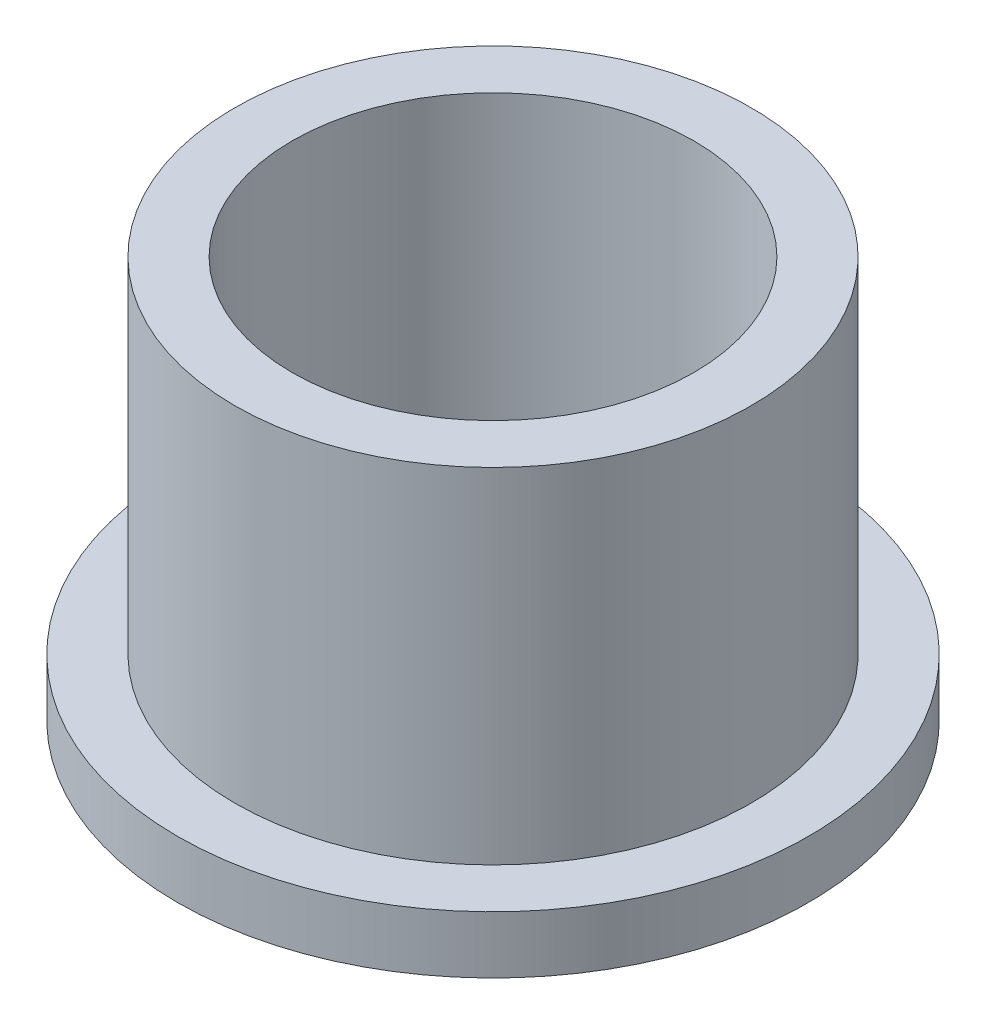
from build123d import *

# Parameters (mm, degrees)
SKETCH2_R           = 9
SKETCH2_R_2         = 7
BOSS_EXTRUDE1_DEPTH = 14
SKETCH3_R           = 11
SKETCH3_R_2         = 9
BOSS_EXTRUDE2_DEPTH = 2


with BuildPart() as part:
    # Sketch2 → Boss-Extrude1 (new body)
    with BuildSketch(Plane(origin=(0, 0, 0), x_dir=(1, 0, 0), z_dir=(0, 1, 0))):
        with Locations(Location((0, 0, 0), (0, 0, 270))):
            Circle(SKETCH2_R)
        with Locations(Location((0, 0, 0), (0, 0, 270))):
            Circle(SKETCH2_R_2, mode=Mode.SUBTRACT)
    extrude(amount=BOSS_EXTRUDE1_DEPTH)

    # Sketch3 → Boss-Extrude2 (add)
    with BuildSketch(Plane(origin=(0, 0, 0), x_dir=(1, 0, 0), z_dir=(0, 1, 0))):
        with Locations(Location((0, 0, 0), (0, 0, 270))):
            Circle(SKETCH3_R)
        with Locations(Location((0, 0, 0), (0, 0, 270))):
            Circle(SKETCH3_R_2, mode=Mode.SUBTRACT)
    extrude(amount=BOSS_EXTRUDE2_DEPTH)


solid = part.part
